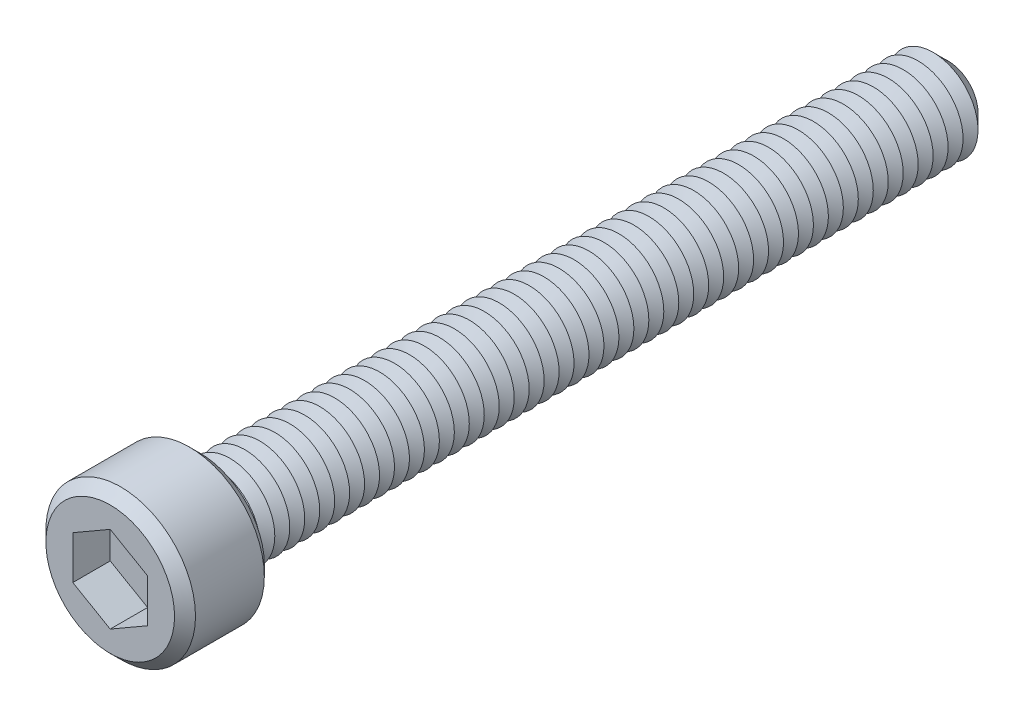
from build123d import *

# Parameters (mm, degrees)
SKETCH1_R           = 5
BOSS_EXTRUDE1_DEPTH = 6
SKETCH2_R           = 3
BOSS_EXTRUDE2_DEPTH = 50
CHAMFER1_SIZE       = 1
LPATTERN1_COUNT     = 49
LPATTERN1_PITCH     = 1
CUT_EXTRUDE1_DEPTH  = 2.5
SKETCH6_R           = 0.8
CUT_EXTRUDE2_DEPTH  = 53.5
CHAMFER2_SIZE       = 0.7


with BuildPart() as part:
    # Sketch1 → Boss-Extrude1 (new body)
    with BuildSketch(Plane.XY):
        Circle(SKETCH1_R)
    extrude(amount=BOSS_EXTRUDE1_DEPTH)

    # Sketch2 → Boss-Extrude2 (add)
    with BuildSketch(Plane(origin=(0, 0, 0), x_dir=(-1, 0, 0), z_dir=(0, 0, -1))):
        Circle(SKETCH2_R)
    extrude(amount=BOSS_EXTRUDE2_DEPTH)

    # Chamfer1
    chamfer1_edges = [part.edges().sort_by_distance(p)[0] for p in [
        (3, 0, -50),
    ]]
    chamfer(chamfer1_edges, length=CHAMFER1_SIZE)

    # Sketch4 → Cut-Revolve1 (revolve, cut)
    with BuildSketch(Plane(origin=(0, 0, 0), x_dir=(0, 0, -1), z_dir=(1, 0, 0)), mode=Mode.PRIVATE) as cut_revolve1_sk:
        Polygon((0, 3), (0.5, 2.133974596), (1, 3), align=None)
    cut_revolve1 = revolve(cut_revolve1_sk.sketch.rotate(Axis((0, 0, 2.512122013), (0, 0, -1)), 90), axis=Axis((0, 0, 2.512122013), (0, 0, -1)), mode=Mode.SUBTRACT)

    # LPattern1: Cut-Revolve1 ×49
    with Locations(*[(0, 0, -i * LPATTERN1_PITCH) for i in range(1, LPATTERN1_COUNT)]):
        add(cut_revolve1, mode=Mode.SUBTRACT)

    # Sketch5 → Cut-Extrude1 (cut)
    with BuildSketch(Plane.XY.offset(6)):
        Polygon((0, 2.886751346), (-2.5, 1.443375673), (-2.5, -1.443375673), (0, -2.886751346), (2.5, -1.443375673), (2.5, 1.443375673), align=None)
    extrude(amount=-CUT_EXTRUDE1_DEPTH, mode=Mode.SUBTRACT)

    # Sketch6 → Cut-Extrude2 (cut)
    with BuildSketch(Plane.XY.offset(3.5)):
        Circle(SKETCH6_R)
    extrude(amount=-CUT_EXTRUDE2_DEPTH, mode=Mode.SUBTRACT)

    # Chamfer2
    chamfer2_edges = [part.edges().sort_by_distance(p)[0] for p in [
        (-5, 0, 0),
        (-5, 0, 6),
    ]]
    chamfer(chamfer2_edges, length=CHAMFER2_SIZE)


solid = part.part
